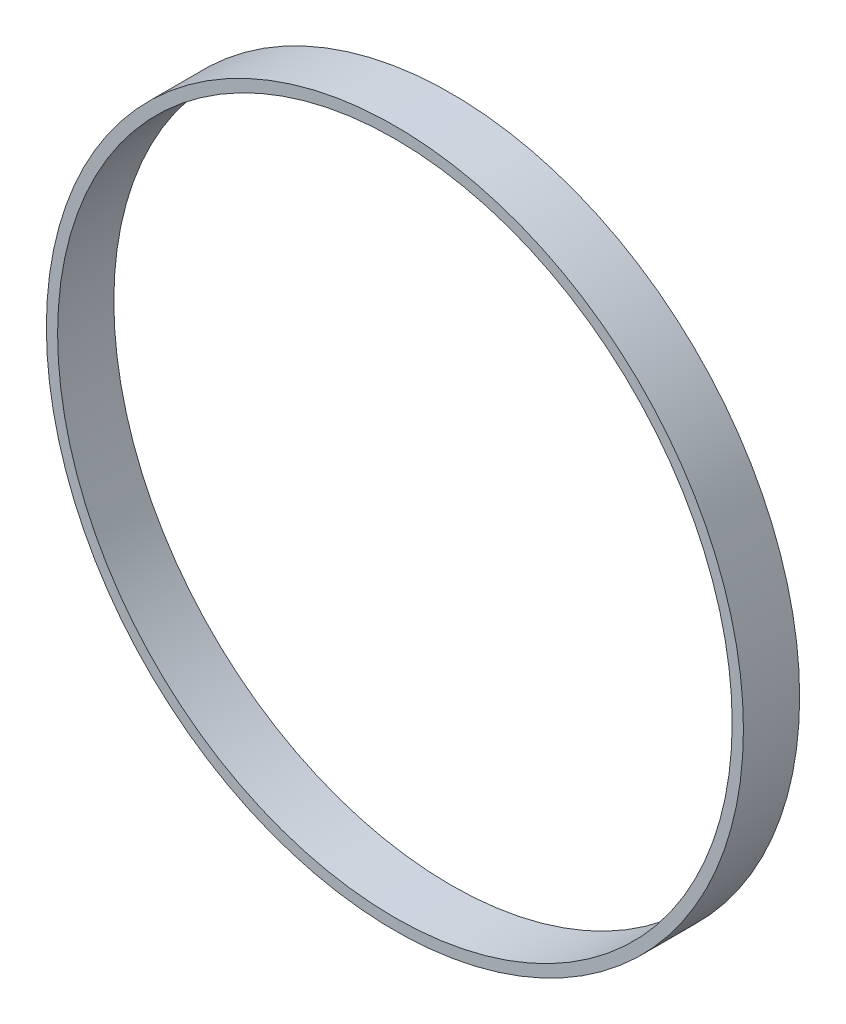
ISO-10303-21;
HEADER;
FILE_DESCRIPTION(('STEP AP214'),'2;1');
FILE_NAME('part.step','',(''),(''),'','','');
FILE_SCHEMA(('AUTOMOTIVE_DESIGN { 1 0 10303 214 1 1 1 1 }'));
ENDSEC;
DATA;
#1=APPLICATION_CONTEXT('core data for automotive mechanical design processes');
#2=APPLICATION_PROTOCOL_DEFINITION('international standard','automotive_design',2000,#1);
#3=PRODUCT_CONTEXT('',#1,'mechanical');
#4=PRODUCT('Part','Part','',(#3));
#5=PRODUCT_RELATED_PRODUCT_CATEGORY('part','',(#4));
#6=PRODUCT_DEFINITION_FORMATION('','',#4);
#7=PRODUCT_DEFINITION_CONTEXT('part definition',#1,'design');
#8=PRODUCT_DEFINITION('design','',#6,#7);
#9=PRODUCT_DEFINITION_SHAPE('','',#8);
#10=(LENGTH_UNIT() NAMED_UNIT(*) SI_UNIT(.MILLI.,.METRE.));
#11=(NAMED_UNIT(*) PLANE_ANGLE_UNIT() SI_UNIT($,.RADIAN.));
#12=(NAMED_UNIT(*) SI_UNIT($,.STERADIAN.) SOLID_ANGLE_UNIT());
#13=UNCERTAINTY_MEASURE_WITH_UNIT(LENGTH_MEASURE(1.E-05),#10,'distance_accuracy_value','');
#14=(GEOMETRIC_REPRESENTATION_CONTEXT(3) GLOBAL_UNCERTAINTY_ASSIGNED_CONTEXT((#13)) GLOBAL_UNIT_ASSIGNED_CONTEXT((#10,
#11,#12)) REPRESENTATION_CONTEXT('',''));
#15=CARTESIAN_POINT('',(0.,0.,0.));
#16=DIRECTION('',(0.,0.,1.));
#17=DIRECTION('',(1.,0.,0.));
#18=AXIS2_PLACEMENT_3D('',#15,#16,#17);
#19=CARTESIAN_POINT('',(0.,0.,5.));
#20=DIRECTION('',(0.,0.,1.));
#21=DIRECTION('',(1.,0.,0.));
#22=AXIS2_PLACEMENT_3D('',#19,#20,#21);
#23=PLANE('',#22);
#24=CARTESIAN_POINT('',(0.,0.,5.));
#25=DIRECTION('',(0.,0.,1.));
#26=DIRECTION('',(1.,0.,0.));
#27=AXIS2_PLACEMENT_3D('',#24,#25,#26);
#28=CIRCLE('',#27,31.);
#29=CARTESIAN_POINT('',(31.,0.,5.));
#30=VERTEX_POINT('',#29);
#31=EDGE_CURVE('E10',#30,#30,#28,.T.);
#32=ORIENTED_EDGE('',*,*,#31,.T.);
#33=EDGE_LOOP('',(#32));
#34=FACE_BOUND('',#33,.T.);
#35=CARTESIAN_POINT('',(0.,0.,5.));
#36=DIRECTION('',(0.,0.,1.));
#37=DIRECTION('',(1.,0.,0.));
#38=AXIS2_PLACEMENT_3D('',#35,#36,#37);
#39=CIRCLE('',#38,30.);
#40=CARTESIAN_POINT('',(30.,0.,5.));
#41=VERTEX_POINT('',#40);
#42=EDGE_CURVE('E35',#41,#41,#39,.T.);
#43=ORIENTED_EDGE('',*,*,#42,.F.);
#44=EDGE_LOOP('',(#43));
#45=FACE_BOUND('',#44,.T.);
#46=ADVANCED_FACE('F24',(#34,#45),#23,.T.);
#47=CARTESIAN_POINT('',(0.,0.,0.));
#48=DIRECTION('',(0.,0.,1.));
#49=DIRECTION('',(1.,0.,0.));
#50=AXIS2_PLACEMENT_3D('',#47,#48,#49);
#51=PLANE('',#50);
#52=CARTESIAN_POINT('',(0.,0.,0.));
#53=DIRECTION('',(0.,0.,1.));
#54=DIRECTION('',(1.,0.,0.));
#55=AXIS2_PLACEMENT_3D('',#52,#53,#54);
#56=CIRCLE('',#55,31.);
#57=CARTESIAN_POINT('',(31.,0.,0.));
#58=VERTEX_POINT('',#57);
#59=EDGE_CURVE('E31',#58,#58,#56,.T.);
#60=ORIENTED_EDGE('',*,*,#59,.F.);
#61=EDGE_LOOP('',(#60));
#62=FACE_BOUND('',#61,.T.);
#63=CARTESIAN_POINT('',(0.,0.,0.));
#64=DIRECTION('',(0.,0.,1.));
#65=DIRECTION('',(1.,0.,0.));
#66=AXIS2_PLACEMENT_3D('',#63,#64,#65);
#67=CIRCLE('',#66,30.);
#68=CARTESIAN_POINT('',(30.,0.,0.));
#69=VERTEX_POINT('',#68);
#70=EDGE_CURVE('E39',#69,#69,#67,.T.);
#71=ORIENTED_EDGE('',*,*,#70,.T.);
#72=EDGE_LOOP('',(#71));
#73=FACE_BOUND('',#72,.T.);
#74=ADVANCED_FACE('F45',(#62,#73),#51,.F.);
#75=CARTESIAN_POINT('',(0.,0.,5.));
#76=DIRECTION('',(0.,0.,-1.));
#77=DIRECTION('',(-1.,0.,0.));
#78=AXIS2_PLACEMENT_3D('',#75,#76,#77);
#79=CYLINDRICAL_SURFACE('',#78,31.);
#80=ORIENTED_EDGE('',*,*,#31,.F.);
#81=EDGE_LOOP('',(#80));
#82=FACE_BOUND('',#81,.T.);
#83=ORIENTED_EDGE('',*,*,#59,.T.);
#84=EDGE_LOOP('',(#83));
#85=FACE_BOUND('',#84,.T.);
#86=ADVANCED_FACE('F26',(#82,#85),#79,.T.);
#87=CARTESIAN_POINT('',(0.,0.,5.));
#88=DIRECTION('',(0.,0.,-1.));
#89=DIRECTION('',(-1.,0.,0.));
#90=AXIS2_PLACEMENT_3D('',#87,#88,#89);
#91=CYLINDRICAL_SURFACE('',#90,30.);
#92=ORIENTED_EDGE('',*,*,#42,.T.);
#93=EDGE_LOOP('',(#92));
#94=FACE_BOUND('',#93,.T.);
#95=ORIENTED_EDGE('',*,*,#70,.F.);
#96=EDGE_LOOP('',(#95));
#97=FACE_BOUND('',#96,.T.);
#98=ADVANCED_FACE('F47',(#94,#97),#91,.F.);
#99=CLOSED_SHELL('',(#46,#74,#86,#98));
#100=MANIFOLD_SOLID_BREP('B2',#99);
#101=ADVANCED_BREP_SHAPE_REPRESENTATION('',(#18,#100),#14);
#102=SHAPE_DEFINITION_REPRESENTATION(#9,#101);
ENDSEC;
END-ISO-10303-21;
